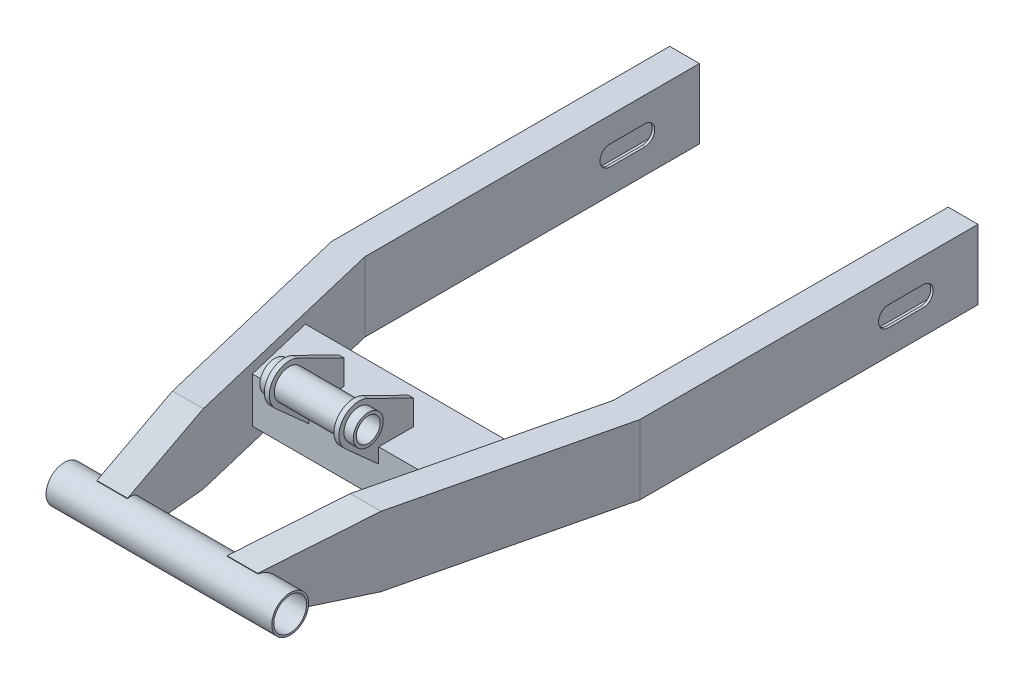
from build123d import *
from OCP.BRepFilletAPI import BRepFilletAPI_MakeChamfer

# Parameters (mm, degrees)
EXTRUSION1_DEPTH             = 35
EXTRUSION1_2_DEPTH           = 35
ESQUISSE2_W                  = 227
ESQUISSE2_H                  = 18.5
CHANFREIN1_SIZE              = 16
CHANFREIN1_SIZE2             = 100
CHANFREIN2_SIZE              = 100
CHANFREIN2_SIZE2             = 16
ESQUISSE3_W                  = 227
ESQUISSE3_H                  = 16.5
COQUE1_T                     = -2.5
ESQUISSE6_R                  = 15
ESQUISSE6_R_2                = 12
EXTRUSION4_DEPTH             = 47
EXTRUSION6_REACH             = 673.858
EXTRUSION6_DIRECTION_2_REACH = 673.858
ESQUISSE7_R                  = 12
EXTRUSION5_DEPTH             = 2.5
R_P_TITION_LIN_AIRE1_COUNT   = 2
R_P_TITION_LIN_AIRE1_PITCH   = 70
ENL_V_MAT_EXTRU_1_DEPTH      = 673.395635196
ENL_V_MAT_EXTRU_1_DEPTH_BACK = 673.395635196


with BuildPart() as part:
    # Esquisse1 → Extrusion1 (new, symmetric)
    with BuildSketch(Plane(origin=(0, 0, 0), x_dir=(1, 0, 0), z_dir=(0, 1, 0))):
        Polygon((-125, 313.538171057), (-50, 0), (-80.846349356, 0), (-155, 310), (-155, 650), (-125, 650), align=None)
    extrude(amount=EXTRUSION1_DEPTH, both=True)



with BuildPart() as body_2:
    # Esquisse1 → Extrusion1 2 (new, symmetric)
    with BuildSketch(Plane(origin=(0, 0, 0), x_dir=(1, 0, 0), z_dir=(0, 1, 0))):
        Polygon((125, 650), (125, 313.538171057), (50, 0), (80.846349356, 0), (155, 310), (155, 650), align=None)
    extrude(amount=EXTRUSION1_2_DEPTH, both=True)


with BuildPart() as part_1:
    add(part.part)

    add(body_2.part)  # R_volution1 merges body 2
    # Esquisse2 → R_volution1 (revolve)
    with BuildSketch(Plane(origin=(0, 0, 0), x_dir=(1, 0, 0), z_dir=(0, 1, 0)), mode=Mode.PRIVATE) as r_volution1_sk:
        with Locations((0, 9.25)):
            Rectangle(ESQUISSE2_W, ESQUISSE2_H)
    revolve(r_volution1_sk.sketch.rotate(Axis((-241.610738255, 0, 0), (1, 0, 0)), 180), axis=Axis((-241.610738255, 0, 0), (1, 0, 0)))

    # Chanfrein1: one chamfer whose edges measure the first distance from different faces: ONE call of the kernel's chamfer builder (chamfer() names one face for all edges)
    chanfrein1_edges_1 = [part_1.edges().sort_by_distance(p)[0] for p in [
        (-65.423174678, 35, 0),
    ]]
    chanfrein1_side_1 = [part_1.faces().sort_by_distance(p)[0] for p in [
        (-65.423174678, 26.75, 0),
    ]]
    chanfrein1_edges_2 = [part_1.edges().sort_by_distance(p)[0] for p in [
        (65.423174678, 35, 0),
    ]]
    chanfrein1_side_2 = [part_1.faces().sort_by_distance(p)[0] for p in [
        (65.423174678, 26.75, 0),
    ]]
    chanfrein1 = BRepFilletAPI_MakeChamfer(part_1.part.solid().wrapped)
    for e in chanfrein1_edges_1:
        chanfrein1.Add(CHANFREIN1_SIZE, CHANFREIN1_SIZE2, e.wrapped, chanfrein1_side_1[0].wrapped)  # the first distance lies on this face
    for e in chanfrein1_edges_2:
        chanfrein1.Add(CHANFREIN1_SIZE, CHANFREIN1_SIZE2, e.wrapped, chanfrein1_side_2[0].wrapped)  # the first distance lies on this face
    add(Compound.cast(chanfrein1.Shape()), mode=Mode.REPLACE)

    # Chanfrein2: one chamfer whose edges measure the first distance from different faces: ONE call of the kernel's chamfer builder (chamfer() names one face for all edges)
    chanfrein2_edges_1 = [part_1.edges().sort_by_distance(p)[0] for p in [
        (65.423174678, -35, 0),
    ]]
    chanfrein2_side_1 = [part_1.faces().sort_by_distance(p)[0] for p in [
        (131.584261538, -35, -481.769085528),
    ]]
    chanfrein2_edges_2 = [part_1.edges().sort_by_distance(p)[0] for p in [
        (-65.423174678, -35, 0),
    ]]
    chanfrein2_side_2 = [part_1.faces().sort_by_distance(p)[0] for p in [
        (-93.903605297, -35, -155.237309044),
    ]]
    chanfrein2 = BRepFilletAPI_MakeChamfer(part_1.part.solid().wrapped)
    for e in chanfrein2_edges_1:
        chanfrein2.Add(CHANFREIN2_SIZE, CHANFREIN2_SIZE2, e.wrapped, chanfrein2_side_1[0].wrapped)  # the first distance lies on this face
    for e in chanfrein2_edges_2:
        chanfrein2.Add(CHANFREIN2_SIZE, CHANFREIN2_SIZE2, e.wrapped, chanfrein2_side_2[0].wrapped)  # the first distance lies on this face
    add(Compound.cast(chanfrein2.Shape()), mode=Mode.REPLACE)

    # Esquisse3 → Enl_vement de mati_re-R_volution1 (revolve, cut)
    with BuildSketch(Plane(origin=(0, 0, 0), x_dir=(1, 0, 0), z_dir=(0, 1, 0)), mode=Mode.PRIVATE) as enl_vement_de_mati_re_r_volution1_sk:
        with Locations((0, 8.25)):
            Rectangle(ESQUISSE3_W, ESQUISSE3_H)
    revolve(enl_vement_de_mati_re_r_volution1_sk.sketch.rotate(Axis((-216.686448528, 0, 0), (1, 0, 0)), 180), axis=Axis((-216.686448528, 0, 0), (1, 0, 0)), mode=Mode.SUBTRACT)

    # Coque1
    coque1_openings = [part_1.faces().sort_by_distance(p)[0] for p in [
        (-140, 0, -650),
        (140, 0, -650),
    ]]
    offset(amount=COQUE1_T, openings=coque1_openings, kind=Kind.INTERSECTION)

    # Extrusion6: up to this plane
    extrusion6_end = Plane(origin=(-125, 35, -313.538171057), z_dir=(-0.9725624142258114, 0, 0.23264210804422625))
    # Esquisse9 → Extrusion6 (add, up to the surface)
    with BuildSketch(Plane(origin=(0, 0, 0), x_dir=(0, 0, -1), z_dir=(1, 0, 0)), mode=Mode.PRIVATE) as extrusion6_sk1:
        Polygon((165, 25), (235, 25), (235, -35.5), (180, -35.5), (165, -20.5), align=None)
        Polygon((168, 22), (168, -19.257359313), (181.242640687, -32.5), (232, -32.5), (232, 22), align=None, mode=Mode.SUBTRACT)
    extrusion6_tool1 = split(extrude(extrusion6_sk1.sketch, amount=-EXTRUSION6_REACH, mode=Mode.PRIVATE), bisect_by=extrusion6_end, keep=Keep.BOTH, mode=Mode.PRIVATE)
    add(extrusion6_tool1.solids().sort_by_distance((0, 24.074784, -200))[0])

    # Extrusion6 direction 2: up to this plane
    extrusion6_direction_2_end = Plane(origin=(125, 35, -313.538171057), z_dir=(0.9725624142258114, 0, 0.23264210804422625))
    # Esquisse9 → Extrusion6 direction 2 (add, up to the surface)
    with BuildSketch(Plane(origin=(0, 0, 0), x_dir=(0, 0, -1), z_dir=(1, 0, 0)), mode=Mode.PRIVATE) as extrusion6_direction_2_sk1:
        Polygon((165, 25), (235, 25), (235, -35.5), (180, -35.5), (165, -20.5), align=None)
        Polygon((168, 22), (168, -19.257359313), (181.242640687, -32.5), (232, -32.5), (232, 22), align=None, mode=Mode.SUBTRACT)
    extrusion6_direction_2_tool1 = split(extrude(extrusion6_direction_2_sk1.sketch, amount=EXTRUSION6_DIRECTION_2_REACH, mode=Mode.PRIVATE), bisect_by=extrusion6_direction_2_end, keep=Keep.BOTH, mode=Mode.PRIVATE)
    add(extrusion6_direction_2_tool1.solids().sort_by_distance((0, 24.074784, -200))[0])



with BuildPart() as body_2_2:
    # Esquisse6 → Extrusion4 (new, symmetric)
    with BuildSketch(Plane(origin=(0, 0, 0), x_dir=(0, 0, -1), z_dir=(1, 0, 0))):
        with Locations((145, 54.772255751)):
            Circle(ESQUISSE6_R)
        with Locations((145, 54.772255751)):
            Circle(ESQUISSE6_R_2, mode=Mode.SUBTRACT)
    extrude(amount=EXTRUSION4_DEPTH, both=True)


with BuildPart() as part_2:
    add(part_1.part)

    add(body_2_2.part)  # Extrusion5 merges body 2 2
    # Esquisse7 → Extrusion5 (add, symmetric)
    with BuildSketch(Plane(origin=(35, 0, 0), x_dir=(0, 0, -1), z_dir=(1, 0, 0))):
        with BuildLine():
            Line((165, 25), (165, 10))
            Line((165, 10), (131.654038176, 39.876440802))
            ThreePointArc((131.654038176, 39.876440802), (128.424901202, 65.964489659), (153.829811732, 72.717573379))
            Line((153.829811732, 72.717573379), (200, 50))
            Line((200, 50), (200, 25))
            Line((200, 25), (165, 25))
        make_face()
        with Locations((145, 54.772255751)):
            Circle(ESQUISSE7_R, mode=Mode.SUBTRACT)
    extrusion5 = extrude(amount=EXTRUSION5_DEPTH, both=True)

    # R_p_tition lin_aire1: Extrusion5 ×2
    with Locations(*[(-i * R_P_TITION_LIN_AIRE1_PITCH, 0, 0) for i in range(1, R_P_TITION_LIN_AIRE1_COUNT)]):
        add(extrusion5)

    # Esquisse8 → Enl_v. mat.-Extru.1 (cut, two sides: drawn at the far end of the back side and taken through both)
    with BuildSketch(Plane(origin=(0, 0, 0), x_dir=(0, 0, -1), z_dir=(1, 0, 0)).offset(-ENL_V_MAT_EXTRU_1_DEPTH_BACK)):
        with BuildLine():
            Line((595, 10), (560, 10))
            ThreePointArc((560, 10), (550, 0), (560, -10))
            Line((560, -10), (595, -10))
            ThreePointArc((595, -10), (605, 0), (595, 10))
        make_face()
    extrude(amount=ENL_V_MAT_EXTRU_1_DEPTH + ENL_V_MAT_EXTRU_1_DEPTH_BACK, mode=Mode.SUBTRACT)


solid = part_2.part
